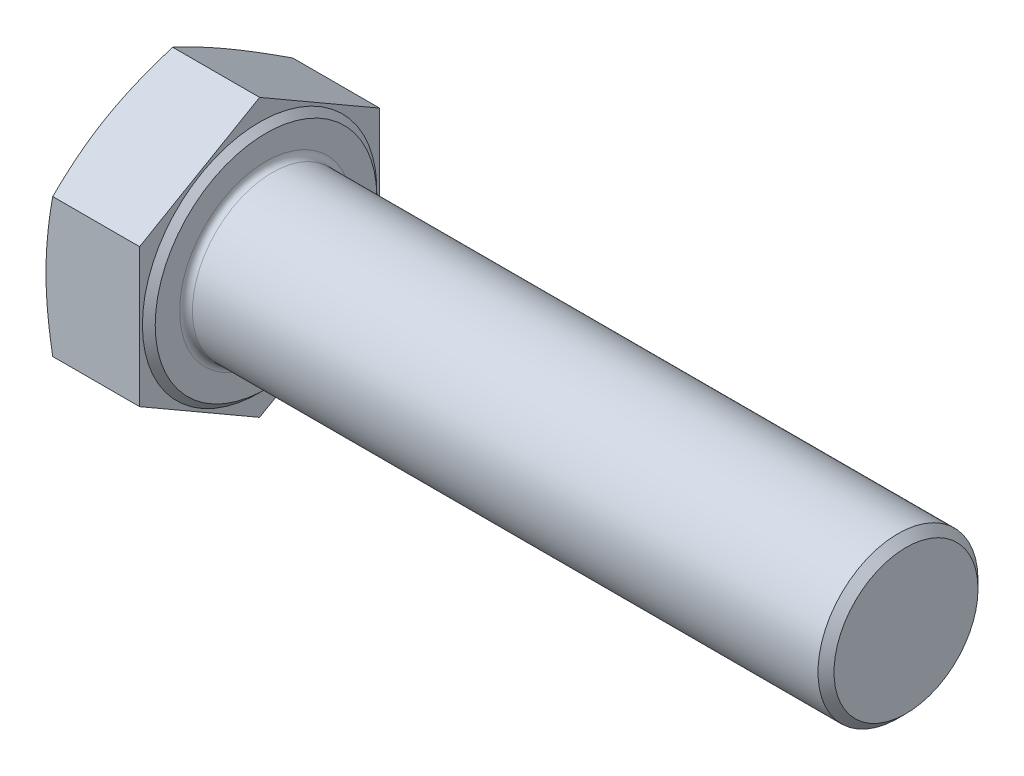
ISO-10303-21;
HEADER;
FILE_DESCRIPTION(('STEP AP214'),'2;1');
FILE_NAME('part.step','',(''),(''),'','','');
FILE_SCHEMA(('AUTOMOTIVE_DESIGN { 1 0 10303 214 1 1 1 1 }'));
ENDSEC;
DATA;
#1=APPLICATION_CONTEXT('core data for automotive mechanical design processes');
#2=APPLICATION_PROTOCOL_DEFINITION('international standard','automotive_design',2000,#1);
#3=PRODUCT_CONTEXT('',#1,'mechanical');
#4=PRODUCT('Part','Part','',(#3));
#5=PRODUCT_RELATED_PRODUCT_CATEGORY('part','',(#4));
#6=PRODUCT_DEFINITION_FORMATION('','',#4);
#7=PRODUCT_DEFINITION_CONTEXT('part definition',#1,'design');
#8=PRODUCT_DEFINITION('design','',#6,#7);
#9=PRODUCT_DEFINITION_SHAPE('','',#8);
#10=(LENGTH_UNIT() NAMED_UNIT(*) SI_UNIT(.MILLI.,.METRE.));
#11=(NAMED_UNIT(*) PLANE_ANGLE_UNIT() SI_UNIT($,.RADIAN.));
#12=(NAMED_UNIT(*) SI_UNIT($,.STERADIAN.) SOLID_ANGLE_UNIT());
#13=UNCERTAINTY_MEASURE_WITH_UNIT(LENGTH_MEASURE(1.E-05),#10,'distance_accuracy_value','');
#14=(GEOMETRIC_REPRESENTATION_CONTEXT(3) GLOBAL_UNCERTAINTY_ASSIGNED_CONTEXT((#13)) GLOBAL_UNIT_ASSIGNED_CONTEXT((#10,
#11,#12)) REPRESENTATION_CONTEXT('',''));
#15=CARTESIAN_POINT('',(0.,0.,0.));
#16=DIRECTION('',(0.,0.,1.));
#17=DIRECTION('',(1.,0.,0.));
#18=AXIS2_PLACEMENT_3D('',#15,#16,#17);
#19=CARTESIAN_POINT('',(12.5,-25.9807621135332,-15.));
#20=DIRECTION('',(1.,0.,0.));
#21=DIRECTION('',(0.,0.,-1.));
#22=AXIS2_PLACEMENT_3D('',#19,#20,#21);
#23=PLANE('',#22);
#24=CARTESIAN_POINT('',(12.5,0.,0.));
#25=DIRECTION('',(1.,0.,0.));
#26=DIRECTION('',(0.,0.,-1.));
#27=AXIS2_PLACEMENT_3D('',#24,#25,#26);
#28=CIRCLE('',#27,10.8);
#29=CARTESIAN_POINT('',(12.5,0.,-10.8));
#30=VERTEX_POINT('',#29);
#31=EDGE_CURVE('E11',#30,#30,#28,.F.);
#32=ORIENTED_EDGE('',*,*,#31,.T.);
#33=EDGE_LOOP('',(#32));
#34=FACE_BOUND('',#33,.T.);
#35=CARTESIAN_POINT('',(12.5,0.,0.));
#36=DIRECTION('',(-1.,0.,0.));
#37=DIRECTION('',(0.,0.,1.));
#38=AXIS2_PLACEMENT_3D('',#35,#36,#37);
#39=CIRCLE('',#38,13.85);
#40=CARTESIAN_POINT('',(12.5,0.,13.85));
#41=VERTEX_POINT('',#40);
#42=EDGE_CURVE('E257',#41,#41,#39,.T.);
#43=ORIENTED_EDGE('',*,*,#42,.F.);
#44=EDGE_LOOP('',(#43));
#45=FACE_BOUND('',#44,.T.);
#46=ADVANCED_FACE('F32',(#34,#45),#23,.T.);
#47=CARTESIAN_POINT('',(12.5,-8.66025403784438,15.));
#48=DIRECTION('',(0.,0.866025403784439,-0.5));
#49=DIRECTION('',(0.,0.5,0.866025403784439));
#50=AXIS2_PLACEMENT_3D('',#47,#48,#49);
#51=PLANE('',#50);
#52=CARTESIAN_POINT('',(0.844637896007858,-17.3206235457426,-0.000199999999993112));
#53=CARTESIAN_POINT('',(0.779364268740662,-17.1412736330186,0.310443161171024));
#54=CARTESIAN_POINT('',(0.717026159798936,-16.961660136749,0.621542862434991));
#55=CARTESIAN_POINT('',(0.598866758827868,-16.6018815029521,1.24469773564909));
#56=CARTESIAN_POINT('',(0.543046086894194,-16.4217163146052,1.55675299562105));
#57=CARTESIAN_POINT('',(0.386274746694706,-15.8801582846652,2.49475901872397));
#58=CARTESIAN_POINT('',(0.29610680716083,-15.5179509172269,3.12212058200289));
#59=CARTESIAN_POINT('',(0.186523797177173,-14.9750944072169,4.06237563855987));
#60=CARTESIAN_POINT('',(0.154367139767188,-14.7950715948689,4.3741842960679));
#61=CARTESIAN_POINT('',(0.0988350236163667,-14.4346898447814,4.99838379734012));
#62=CARTESIAN_POINT('',(0.0754592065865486,-14.2543309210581,5.31077461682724));
#63=CARTESIAN_POINT('',(0.0378970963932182,-13.8934354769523,5.93586386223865));
#64=CARTESIAN_POINT('',(0.0237076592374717,-13.7128990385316,6.24856214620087));
#65=CARTESIAN_POINT('',(0.00475912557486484,-13.3517020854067,6.87417362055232));
#66=CARTESIAN_POINT('',(0.,-13.1710415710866,7.18708681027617));
#67=CARTESIAN_POINT('',(0.,-12.8097205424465,7.81291318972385));
#68=CARTESIAN_POINT('',(0.00475912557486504,-12.6290600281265,8.12582637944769));
#69=CARTESIAN_POINT('',(0.0237076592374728,-12.2678630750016,8.75143785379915));
#70=CARTESIAN_POINT('',(0.0378970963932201,-12.0873266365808,9.06413613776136));
#71=CARTESIAN_POINT('',(0.0754592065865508,-11.726431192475,9.68922538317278));
#72=CARTESIAN_POINT('',(0.0988350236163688,-11.5460722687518,10.0016162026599));
#73=CARTESIAN_POINT('',(0.15436713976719,-11.1856905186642,10.6258157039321));
#74=CARTESIAN_POINT('',(0.186523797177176,-11.0056677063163,10.9376243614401));
#75=CARTESIAN_POINT('',(0.296106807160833,-10.4628111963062,11.8778794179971));
#76=CARTESIAN_POINT('',(0.386274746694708,-10.1006038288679,12.505240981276));
#77=CARTESIAN_POINT('',(0.543046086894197,-9.55904579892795,13.443247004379));
#78=CARTESIAN_POINT('',(0.598866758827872,-9.3788806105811,13.7553022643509));
#79=CARTESIAN_POINT('',(0.717026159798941,-9.01910197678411,14.378457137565));
#80=CARTESIAN_POINT('',(0.779364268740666,-8.83948848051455,14.689556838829));
#81=CARTESIAN_POINT('',(0.844637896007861,-8.66013856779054,15.0002));
#82=B_SPLINE_CURVE_WITH_KNOTS('',3,(#52,#53,#54,#55,#56,#57,#58,#59,#60,#61,#62,#63,#64,#65,#66,
#67,#68,#69,#70,#71,#72,#73,#74,#75,#76,#77,#78,#79,#80,#81),.UNSPECIFIED.,.F.,.F.,(4,2,2,2,2,2,
2,2,2,2,2,2,2,2,4),(0.,1.0937389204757,2.18758181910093,4.37677976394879,5.46113055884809,
6.54543710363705,7.62937235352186,8.71330426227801,9.79723617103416,10.881171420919,
11.9654779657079,13.0498287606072,15.2390267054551,16.3328696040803,17.426608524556),.UNSPECIFIED.);
#83=CARTESIAN_POINT('',(0.844595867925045,-17.3205080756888,0.));
#84=VERTEX_POINT('',#83);
#85=CARTESIAN_POINT('',(0.,-12.9903810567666,7.5));
#86=VERTEX_POINT('',#85);
#87=EDGE_CURVE('E276',#84,#86,#82,.T.);
#88=ORIENTED_EDGE('',*,*,#87,.F.);
#89=DIRECTION('',(-1.,0.,0.));
#90=VECTOR('',#89,1.);
#91=CARTESIAN_POINT('',(12.5,-17.3205080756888,0.));
#92=LINE('',#91,#90);
#93=CARTESIAN_POINT('',(11.7,-17.3205080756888,0.));
#94=VERTEX_POINT('',#93);
#95=EDGE_CURVE('E142',#94,#84,#92,.T.);
#96=ORIENTED_EDGE('',*,*,#95,.F.);
#97=DIRECTION('',(0.,-0.5,-0.866025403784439));
#98=VECTOR('',#97,1.);
#99=CARTESIAN_POINT('',(11.7,-8.66025403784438,15.));
#100=LINE('',#99,#98);
#101=CARTESIAN_POINT('',(11.7,-8.66025403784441,15.));
#102=VERTEX_POINT('',#101);
#103=EDGE_CURVE('E133',#102,#94,#100,.T.);
#104=ORIENTED_EDGE('',*,*,#103,.F.);
#105=DIRECTION('',(-1.,0.,0.));
#106=VECTOR('',#105,1.);
#107=CARTESIAN_POINT('',(12.5,-8.66025403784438,15.));
#108=LINE('',#107,#106);
#109=CARTESIAN_POINT('',(0.844595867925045,-8.66025403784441,15.));
#110=VERTEX_POINT('',#109);
#111=EDGE_CURVE('E128',#102,#110,#108,.T.);
#112=ORIENTED_EDGE('',*,*,#111,.T.);
#113=EDGE_CURVE('E121',#86,#110,#82,.T.);
#114=ORIENTED_EDGE('',*,*,#113,.F.);
#115=EDGE_LOOP('',(#88,#96,#104,#112,#114));
#116=FACE_BOUND('',#115,.T.);
#117=ADVANCED_FACE('F34',(#116),#51,.F.);
#118=CARTESIAN_POINT('',(12.5,-17.3205080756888,0.));
#119=DIRECTION('',(0.,0.866025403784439,0.5));
#120=DIRECTION('',(0.,-0.5,0.866025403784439));
#121=AXIS2_PLACEMENT_3D('',#118,#119,#120);
#122=PLANE('',#121);
#123=CARTESIAN_POINT('',(0.844637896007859,-8.66013856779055,-15.0002));
#124=CARTESIAN_POINT('',(0.779364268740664,-8.83948848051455,-14.689556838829));
#125=CARTESIAN_POINT('',(0.717026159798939,-9.01910197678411,-14.378457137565));
#126=CARTESIAN_POINT('',(0.59886675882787,-9.3788806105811,-13.7553022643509));
#127=CARTESIAN_POINT('',(0.543046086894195,-9.55904579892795,-13.443247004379));
#128=CARTESIAN_POINT('',(0.386274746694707,-10.1006038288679,-12.505240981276));
#129=CARTESIAN_POINT('',(0.296106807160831,-10.4628111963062,-11.8778794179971));
#130=CARTESIAN_POINT('',(0.186523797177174,-11.0056677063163,-10.9376243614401));
#131=CARTESIAN_POINT('',(0.154367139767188,-11.1856905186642,-10.6258157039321));
#132=CARTESIAN_POINT('',(0.0988350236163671,-11.5460722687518,-10.0016162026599));
#133=CARTESIAN_POINT('',(0.075459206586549,-11.726431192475,-9.68922538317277));
#134=CARTESIAN_POINT('',(0.0378970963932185,-12.0873266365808,-9.06413613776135));
#135=CARTESIAN_POINT('',(0.0237076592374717,-12.2678630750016,-8.75143785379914));
#136=CARTESIAN_POINT('',(0.0047591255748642,-12.6290600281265,-8.12582637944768));
#137=CARTESIAN_POINT('',(0.,-12.8097205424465,-7.81291318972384));
#138=CARTESIAN_POINT('',(0.,-13.1710415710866,-7.18708681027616));
#139=CARTESIAN_POINT('',(0.00475912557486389,-13.3517020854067,-6.87417362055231));
#140=CARTESIAN_POINT('',(0.0237076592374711,-13.7128990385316,-6.24856214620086));
#141=CARTESIAN_POINT('',(0.0378970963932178,-13.8934354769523,-5.93586386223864));
#142=CARTESIAN_POINT('',(0.0754592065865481,-14.2543309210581,-5.31077461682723));
#143=CARTESIAN_POINT('',(0.0988350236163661,-14.4346898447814,-4.99838379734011));
#144=CARTESIAN_POINT('',(0.154367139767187,-14.7950715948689,-4.37418429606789));
#145=CARTESIAN_POINT('',(0.186523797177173,-14.9750944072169,-4.06237563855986));
#146=CARTESIAN_POINT('',(0.296106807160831,-15.5179509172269,-3.12212058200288));
#147=CARTESIAN_POINT('',(0.386274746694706,-15.8801582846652,-2.49475901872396));
#148=CARTESIAN_POINT('',(0.543046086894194,-16.4217163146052,-1.55675299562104));
#149=CARTESIAN_POINT('',(0.598866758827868,-16.6018815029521,-1.24469773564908));
#150=CARTESIAN_POINT('',(0.717026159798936,-16.961660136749,-0.621542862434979));
#151=CARTESIAN_POINT('',(0.779364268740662,-17.1412736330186,-0.310443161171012));
#152=CARTESIAN_POINT('',(0.844637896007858,-17.3206235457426,0.000200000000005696));
#153=B_SPLINE_CURVE_WITH_KNOTS('',3,(#123,#124,#125,#126,#127,#128,#129,#130,#131,#132,#133,
#134,#135,#136,#137,#138,#139,#140,#141,#142,#143,#144,#145,#146,#147,#148,#149,#150,#151,#152),
.UNSPECIFIED.,.F.,.F.,(4,2,2,2,2,2,2,2,2,2,2,2,2,2,4),(0.,1.0937389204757,2.18758181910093,
4.37677976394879,5.46113055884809,6.54543710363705,7.62937235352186,8.71330426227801,
9.79723617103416,10.881171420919,11.9654779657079,13.0498287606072,15.2390267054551,
16.3328696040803,17.426608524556),.UNSPECIFIED.);
#154=CARTESIAN_POINT('',(0.844595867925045,-8.66025403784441,-15.));
#155=VERTEX_POINT('',#154);
#156=CARTESIAN_POINT('',(0.,-12.9903810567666,-7.49999999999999));
#157=VERTEX_POINT('',#156);
#158=EDGE_CURVE('E229',#155,#157,#153,.T.);
#159=ORIENTED_EDGE('',*,*,#158,.F.);
#160=DIRECTION('',(-1.,0.,0.));
#161=VECTOR('',#160,1.);
#162=CARTESIAN_POINT('',(12.5,-8.66025403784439,-15.));
#163=LINE('',#162,#161);
#164=CARTESIAN_POINT('',(11.7,-8.66025403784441,-15.));
#165=VERTEX_POINT('',#164);
#166=EDGE_CURVE('E139',#165,#155,#163,.T.);
#167=ORIENTED_EDGE('',*,*,#166,.F.);
#168=DIRECTION('',(0.,0.5,-0.866025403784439));
#169=VECTOR('',#168,1.);
#170=CARTESIAN_POINT('',(11.7,-17.3205080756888,0.));
#171=LINE('',#170,#169);
#172=EDGE_CURVE('E266',#94,#165,#171,.T.);
#173=ORIENTED_EDGE('',*,*,#172,.F.);
#174=ORIENTED_EDGE('',*,*,#95,.T.);
#175=EDGE_CURVE('E225',#157,#84,#153,.T.);
#176=ORIENTED_EDGE('',*,*,#175,.F.);
#177=EDGE_LOOP('',(#159,#167,#173,#174,#176));
#178=FACE_BOUND('',#177,.T.);
#179=ADVANCED_FACE('F180',(#178),#122,.F.);
#180=CARTESIAN_POINT('',(12.5,-8.66025403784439,-15.));
#181=DIRECTION('',(0.,0.,1.));
#182=DIRECTION('',(1.,0.,0.));
#183=AXIS2_PLACEMENT_3D('',#180,#181,#182);
#184=PLANE('',#183);
#185=CARTESIAN_POINT('',(4.5131853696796,-22.9293075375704,-15.));
#186=CARTESIAN_POINT('',(4.40983513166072,-22.5899853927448,-15.));
#187=CARTESIAN_POINT('',(4.30710990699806,-22.2504729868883,-15.));
#188=CARTESIAN_POINT('',(4.10304940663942,-21.5710286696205,-15.));
#189=CARTESIAN_POINT('',(4.0017141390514,-21.2310967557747,-15.));
#190=CARTESIAN_POINT('',(3.69999008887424,-20.2105689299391,-15.));
#191=CARTESIAN_POINT('',(3.50189837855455,-19.5292910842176,-15.));
#192=CARTESIAN_POINT('',(3.11288892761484,-18.163310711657,-15.));
#193=CARTESIAN_POINT('',(2.92198526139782,-17.4786041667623,-15.));
#194=CARTESIAN_POINT('',(2.54957050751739,-16.1066443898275,-15.));
#195=CARTESIAN_POINT('',(2.36805925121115,-15.4193912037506,-15.));
#196=CARTESIAN_POINT('',(2.0189263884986,-14.0503721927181,-15.));
#197=CARTESIAN_POINT('',(1.851161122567,-13.368643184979,-15.));
#198=CARTESIAN_POINT('',(1.5299135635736,-12.0017928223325,-15.));
#199=CARTESIAN_POINT('',(1.37643151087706,-11.3166714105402,-15.));
#200=CARTESIAN_POINT('',(1.08732897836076,-9.94288290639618,-15.));
#201=CARTESIAN_POINT('',(0.951702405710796,-9.25421710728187,-15.));
#202=CARTESIAN_POINT('',(0.702440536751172,-7.8728873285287,-15.));
#203=CARTESIAN_POINT('',(0.588804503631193,-7.18022348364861,-15.));
#204=CARTESIAN_POINT('',(0.399391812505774,-5.86889428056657,-15.));
#205=CARTESIAN_POINT('',(0.320798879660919,-5.25063953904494,-15.));
#206=CARTESIAN_POINT('',(0.187759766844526,-4.01151576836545,-15.));
#207=CARTESIAN_POINT('',(0.133312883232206,-3.39064681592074,-15.));
#208=CARTESIAN_POINT('',(0.0511879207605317,-2.14755397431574,-15.));
#209=CARTESIAN_POINT('',(0.0234909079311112,-1.52533135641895,-15.));
#210=CARTESIAN_POINT('',(-0.00373201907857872,-0.280263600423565,-15.));
#211=CARTESIAN_POINT('',(-0.0032581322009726,0.342581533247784,-15.));
#212=CARTESIAN_POINT('',(0.0259087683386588,1.5907602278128,-15.));
#213=CARTESIAN_POINT('',(0.0547448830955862,2.21609038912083,-15.));
#214=CARTESIAN_POINT('',(0.139309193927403,3.46491396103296,-15.));
#215=CARTESIAN_POINT('',(0.195038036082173,4.08840732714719,-15.));
#216=CARTESIAN_POINT('',(0.330780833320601,5.33324943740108,-15.));
#217=CARTESIAN_POINT('',(0.410815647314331,5.95459587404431,-15.));
#218=CARTESIAN_POINT('',(0.591923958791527,7.19418030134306,-15.));
#219=CARTESIAN_POINT('',(0.692997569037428,7.81241827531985,-15.));
#220=CARTESIAN_POINT('',(0.918710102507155,9.07831857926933,-15.));
#221=CARTESIAN_POINT('',(1.04431272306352,9.72580754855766,-15.));
#222=CARTESIAN_POINT('',(1.3116837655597,11.0174604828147,-15.));
#223=CARTESIAN_POINT('',(1.45345340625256,11.6616241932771,-15.));
#224=CARTESIAN_POINT('',(1.75018161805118,12.9470856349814,-15.));
#225=CARTESIAN_POINT('',(1.90514401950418,13.5883824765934,-15.));
#226=CARTESIAN_POINT('',(2.22573697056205,14.8682746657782,-15.));
#227=CARTESIAN_POINT('',(2.39136726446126,15.5068700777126,-15.));
#228=CARTESIAN_POINT('',(2.73152020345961,16.7825582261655,-15.));
#229=CARTESIAN_POINT('',(2.90605399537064,17.419647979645,-15.));
#230=CARTESIAN_POINT('',(3.26222144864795,18.6918370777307,-15.));
#231=CARTESIAN_POINT('',(3.4438551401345,19.3269364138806,-15.));
#232=CARTESIAN_POINT('',(3.81292279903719,20.5953282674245,-15.));
#233=CARTESIAN_POINT('',(4.00035578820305,21.2286210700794,-15.));
#234=CARTESIAN_POINT('',(4.38004374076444,22.4937555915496,-15.));
#235=CARTESIAN_POINT('',(4.57229869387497,23.1255973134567,-15.));
#236=CARTESIAN_POINT('',(4.95868121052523,24.3810727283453,-15.));
#237=CARTESIAN_POINT('',(5.15276465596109,25.0047200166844,-15.));
#238=CARTESIAN_POINT('',(5.54424157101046,26.2509755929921,-15.));
#239=CARTESIAN_POINT('',(5.74163505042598,26.8735838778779,-15.));
#240=CARTESIAN_POINT('',(6.33801421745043,28.7401261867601,-15.));
#241=CARTESIAN_POINT('',(6.74118201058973,29.9827239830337,-15.));
#242=CARTESIAN_POINT('',(7.55410304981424,32.4605337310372,-15.));
#243=CARTESIAN_POINT('',(7.96382550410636,33.6957558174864,-15.));
#244=CARTESIAN_POINT('',(8.58295834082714,35.5470094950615,-15.));
#245=CARTESIAN_POINT('',(8.79008571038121,36.1638059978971,-15.));
#246=CARTESIAN_POINT('',(9.20568070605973,37.3969457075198,-15.));
#247=CARTESIAN_POINT('',(9.41414832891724,38.0132889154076,-15.));
#248=CARTESIAN_POINT('',(9.62319587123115,38.6294352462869,-15.));
#249=B_SPLINE_CURVE_WITH_KNOTS('',3,(#185,#186,#187,#188,#189,#190,#191,#192,#193,#194,#195,
#196,#197,#198,#199,#200,#201,#202,#203,#204,#205,#206,#207,#208,#209,#210,#211,#212,#213,#214,
#215,#216,#217,#218,#219,#220,#221,#222,#223,#224,#225,#226,#227,#228,#229,#230,#231,#232,#233,
#234,#235,#236,#237,#238,#239,#240,#241,#242,#243,#244,#245,#246,#247,#248),.UNSPECIFIED.,.F.,
.F.,(4,2,2,2,2,2,2,2,2,2,2,2,2,2,2,2,2,2,2,2,2,2,2,2,2,2,2,2,2,2,2,4),(0.,1.06413565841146,
2.12827752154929,4.25671855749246,6.38913073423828,8.5215046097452,10.6275874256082,
12.7337056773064,14.8391033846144,16.9444305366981,18.81371040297,20.6829357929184,
22.5508371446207,24.4187253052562,26.2960864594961,28.1734927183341,30.052514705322,
31.9315467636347,33.9099705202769,35.888543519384,37.8676929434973,39.8467949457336,
41.8284386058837,43.8100906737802,45.7914102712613,47.7727256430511,49.732163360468,
51.6916068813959,55.6106625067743,59.5148479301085,61.4667833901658,63.4187140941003),.UNSPECIFIED.);
#250=CARTESIAN_POINT('',(0.844595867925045,8.66025403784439,-15.));
#251=VERTEX_POINT('',#250);
#252=CARTESIAN_POINT('',(0.,0.,-15.));
#253=VERTEX_POINT('',#252);
#254=EDGE_CURVE('E292',#251,#253,#249,.F.);
#255=ORIENTED_EDGE('',*,*,#254,.F.);
#256=DIRECTION('',(-1.,0.,0.));
#257=VECTOR('',#256,1.);
#258=CARTESIAN_POINT('',(12.5,8.6602540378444,-15.));
#259=LINE('',#258,#257);
#260=CARTESIAN_POINT('',(11.7,8.66025403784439,-15.));
#261=VERTEX_POINT('',#260);
#262=EDGE_CURVE('E130',#261,#251,#259,.T.);
#263=ORIENTED_EDGE('',*,*,#262,.F.);
#264=DIRECTION('',(0.,1.,0.));
#265=VECTOR('',#264,1.);
#266=CARTESIAN_POINT('',(11.7,-8.66025403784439,-15.));
#267=LINE('',#266,#265);
#268=EDGE_CURVE('E259',#165,#261,#267,.T.);
#269=ORIENTED_EDGE('',*,*,#268,.F.);
#270=ORIENTED_EDGE('',*,*,#166,.T.);
#271=EDGE_CURVE('E230',#253,#155,#249,.F.);
#272=ORIENTED_EDGE('',*,*,#271,.F.);
#273=EDGE_LOOP('',(#255,#263,#269,#270,#272));
#274=FACE_BOUND('',#273,.T.);
#275=ADVANCED_FACE('F238',(#274),#184,.F.);
#276=CARTESIAN_POINT('',(12.5,8.6602540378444,-15.));
#277=DIRECTION('',(0.,-0.866025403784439,0.5));
#278=DIRECTION('',(0.,-0.5,-0.866025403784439));
#279=AXIS2_PLACEMENT_3D('',#276,#277,#278);
#280=PLANE('',#279);
#281=CARTESIAN_POINT('',(0.844637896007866,17.3206235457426,0.000199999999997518));
#282=CARTESIAN_POINT('',(0.77936426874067,17.1412736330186,-0.31044316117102));
#283=CARTESIAN_POINT('',(0.717026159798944,16.9616601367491,-0.621542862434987));
#284=CARTESIAN_POINT('',(0.598866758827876,16.6018815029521,-1.24469773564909));
#285=CARTESIAN_POINT('',(0.543046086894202,16.4217163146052,-1.55675299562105));
#286=CARTESIAN_POINT('',(0.386274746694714,15.8801582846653,-2.49475901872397));
#287=CARTESIAN_POINT('',(0.296106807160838,15.5179509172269,-3.12212058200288));
#288=CARTESIAN_POINT('',(0.18652379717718,14.9750944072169,-4.06237563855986));
#289=CARTESIAN_POINT('',(0.154367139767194,14.795071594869,-4.37418429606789));
#290=CARTESIAN_POINT('',(0.0988350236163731,14.4346898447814,-4.99838379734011));
#291=CARTESIAN_POINT('',(0.0754592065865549,14.2543309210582,-5.31077461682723));
#292=CARTESIAN_POINT('',(0.0378970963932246,13.8934354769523,-5.93586386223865));
#293=CARTESIAN_POINT('',(0.0237076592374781,13.7128990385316,-6.24856214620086));
#294=CARTESIAN_POINT('',(0.00475912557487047,13.3517020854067,-6.87417362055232));
#295=CARTESIAN_POINT('',(0.,13.1710415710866,-7.18708681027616));
#296=CARTESIAN_POINT('',(0.,12.8097205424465,-7.81291318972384));
#297=CARTESIAN_POINT('',(0.00475912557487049,12.6290600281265,-8.12582637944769));
#298=CARTESIAN_POINT('',(0.023707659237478,12.2678630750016,-8.75143785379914));
#299=CARTESIAN_POINT('',(0.0378970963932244,12.0873266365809,-9.06413613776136));
#300=CARTESIAN_POINT('',(0.0754592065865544,11.726431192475,-9.68922538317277));
#301=CARTESIAN_POINT('',(0.0988350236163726,11.5460722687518,-10.0016162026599));
#302=CARTESIAN_POINT('',(0.154367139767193,11.1856905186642,-10.6258157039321));
#303=CARTESIAN_POINT('',(0.186523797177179,11.0056677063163,-10.9376243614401));
#304=CARTESIAN_POINT('',(0.296106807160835,10.4628111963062,-11.8778794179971));
#305=CARTESIAN_POINT('',(0.386274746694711,10.1006038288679,-12.505240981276));
#306=CARTESIAN_POINT('',(0.543046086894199,9.55904579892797,-13.443247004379));
#307=CARTESIAN_POINT('',(0.598866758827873,9.37888061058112,-13.7553022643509));
#308=CARTESIAN_POINT('',(0.717026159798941,9.01910197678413,-14.378457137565));
#309=CARTESIAN_POINT('',(0.779364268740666,8.83948848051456,-14.689556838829));
#310=CARTESIAN_POINT('',(0.844637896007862,8.66013856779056,-15.0002));
#311=B_SPLINE_CURVE_WITH_KNOTS('',3,(#281,#282,#283,#284,#285,#286,#287,#288,#289,#290,#291,
#292,#293,#294,#295,#296,#297,#298,#299,#300,#301,#302,#303,#304,#305,#306,#307,#308,#309,#310),
.UNSPECIFIED.,.F.,.F.,(4,2,2,2,2,2,2,2,2,2,2,2,2,2,4),(0.,1.0937389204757,2.18758181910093,
4.37677976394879,5.46113055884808,6.54543710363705,7.62937235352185,8.71330426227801,
9.79723617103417,10.881171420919,11.9654779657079,13.0498287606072,15.2390267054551,
16.3328696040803,17.426608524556),.UNSPECIFIED.);
#312=CARTESIAN_POINT('',(0.844595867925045,17.3205080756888,0.));
#313=VERTEX_POINT('',#312);
#314=CARTESIAN_POINT('',(0.,12.9903810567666,-7.5));
#315=VERTEX_POINT('',#314);
#316=EDGE_CURVE('E48',#313,#315,#311,.T.);
#317=ORIENTED_EDGE('',*,*,#316,.F.);
#318=DIRECTION('',(-1.,0.,0.));
#319=VECTOR('',#318,1.);
#320=CARTESIAN_POINT('',(12.5,17.3205080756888,0.));
#321=LINE('',#320,#319);
#322=CARTESIAN_POINT('',(11.7,17.3205080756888,0.));
#323=VERTEX_POINT('',#322);
#324=EDGE_CURVE('E127',#323,#313,#321,.T.);
#325=ORIENTED_EDGE('',*,*,#324,.F.);
#326=DIRECTION('',(0.,0.5,0.866025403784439));
#327=VECTOR('',#326,1.);
#328=CARTESIAN_POINT('',(11.7,8.6602540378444,-15.));
#329=LINE('',#328,#327);
#330=EDGE_CURVE('E256',#261,#323,#329,.T.);
#331=ORIENTED_EDGE('',*,*,#330,.F.);
#332=ORIENTED_EDGE('',*,*,#262,.T.);
#333=EDGE_CURVE('E253',#315,#251,#311,.T.);
#334=ORIENTED_EDGE('',*,*,#333,.F.);
#335=EDGE_LOOP('',(#317,#325,#331,#332,#334));
#336=FACE_BOUND('',#335,.T.);
#337=ADVANCED_FACE('F242',(#336),#280,.F.);
#338=CARTESIAN_POINT('',(12.5,17.3205080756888,0.));
#339=DIRECTION('',(0.,-0.866025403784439,-0.5));
#340=DIRECTION('',(0.,0.5,-0.866025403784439));
#341=AXIS2_PLACEMENT_3D('',#338,#339,#340);
#342=PLANE('',#341);
#343=CARTESIAN_POINT('',(0.844637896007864,8.66013856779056,15.0002));
#344=CARTESIAN_POINT('',(0.779364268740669,8.83948848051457,14.689556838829));
#345=CARTESIAN_POINT('',(0.717026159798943,9.01910197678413,14.378457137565));
#346=CARTESIAN_POINT('',(0.598866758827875,9.37888061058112,13.7553022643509));
#347=CARTESIAN_POINT('',(0.5430460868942,9.55904579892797,13.443247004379));
#348=CARTESIAN_POINT('',(0.386274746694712,10.1006038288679,12.505240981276));
#349=CARTESIAN_POINT('',(0.296106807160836,10.4628111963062,11.8778794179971));
#350=CARTESIAN_POINT('',(0.18652379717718,11.0056677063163,10.9376243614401));
#351=CARTESIAN_POINT('',(0.154367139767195,11.1856905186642,10.6258157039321));
#352=CARTESIAN_POINT('',(0.0988350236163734,11.5460722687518,10.0016162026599));
#353=CARTESIAN_POINT('',(0.0754592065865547,11.726431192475,9.68922538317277));
#354=CARTESIAN_POINT('',(0.0378970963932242,12.0873266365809,9.06413613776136));
#355=CARTESIAN_POINT('',(0.0237076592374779,12.2678630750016,8.75143785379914));
#356=CARTESIAN_POINT('',(0.00475912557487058,12.6290600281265,8.12582637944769));
#357=CARTESIAN_POINT('',(0.,12.8097205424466,7.81291318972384));
#358=CARTESIAN_POINT('',(0.,13.1710415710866,7.18708681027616));
#359=CARTESIAN_POINT('',(0.00475912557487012,13.3517020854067,6.87417362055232));
#360=CARTESIAN_POINT('',(0.0237076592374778,13.7128990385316,6.24856214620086));
#361=CARTESIAN_POINT('',(0.0378970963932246,13.8934354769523,5.93586386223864));
#362=CARTESIAN_POINT('',(0.0754592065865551,14.2543309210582,5.31077461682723));
#363=CARTESIAN_POINT('',(0.0988350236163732,14.4346898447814,4.99838379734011));
#364=CARTESIAN_POINT('',(0.154367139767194,14.795071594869,4.37418429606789));
#365=CARTESIAN_POINT('',(0.18652379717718,14.9750944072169,4.06237563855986));
#366=CARTESIAN_POINT('',(0.296106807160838,15.5179509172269,3.12212058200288));
#367=CARTESIAN_POINT('',(0.386274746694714,15.8801582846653,2.49475901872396));
#368=CARTESIAN_POINT('',(0.543046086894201,16.4217163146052,1.55675299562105));
#369=CARTESIAN_POINT('',(0.598866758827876,16.6018815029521,1.24469773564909));
#370=CARTESIAN_POINT('',(0.717026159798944,16.9616601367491,0.621542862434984));
#371=CARTESIAN_POINT('',(0.77936426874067,17.1412736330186,0.310443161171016));
#372=CARTESIAN_POINT('',(0.844637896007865,17.3206235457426,-0.00020000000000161));
#373=B_SPLINE_CURVE_WITH_KNOTS('',3,(#343,#344,#345,#346,#347,#348,#349,#350,#351,#352,#353,
#354,#355,#356,#357,#358,#359,#360,#361,#362,#363,#364,#365,#366,#367,#368,#369,#370,#371,#372),
.UNSPECIFIED.,.F.,.F.,(4,2,2,2,2,2,2,2,2,2,2,2,2,2,4),(0.,1.0937389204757,2.18758181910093,
4.37677976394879,5.46113055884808,6.54543710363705,7.62937235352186,8.71330426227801,
9.79723617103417,10.881171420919,11.9654779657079,13.0498287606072,15.2390267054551,
16.3328696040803,17.426608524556),.UNSPECIFIED.);
#374=CARTESIAN_POINT('',(0.844595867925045,8.66025403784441,15.));
#375=VERTEX_POINT('',#374);
#376=CARTESIAN_POINT('',(0.,12.9903810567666,7.5));
#377=VERTEX_POINT('',#376);
#378=EDGE_CURVE('E56',#375,#377,#373,.T.);
#379=ORIENTED_EDGE('',*,*,#378,.F.);
#380=DIRECTION('',(-1.,0.,0.));
#381=VECTOR('',#380,1.);
#382=CARTESIAN_POINT('',(12.5,8.6602540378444,15.));
#383=LINE('',#382,#381);
#384=CARTESIAN_POINT('',(11.7,8.6602540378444,15.));
#385=VERTEX_POINT('',#384);
#386=EDGE_CURVE('E118',#385,#375,#383,.T.);
#387=ORIENTED_EDGE('',*,*,#386,.F.);
#388=DIRECTION('',(0.,-0.5,0.866025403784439));
#389=VECTOR('',#388,1.);
#390=CARTESIAN_POINT('',(11.7,17.3205080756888,0.));
#391=LINE('',#390,#389);
#392=EDGE_CURVE('E254',#323,#385,#391,.T.);
#393=ORIENTED_EDGE('',*,*,#392,.F.);
#394=ORIENTED_EDGE('',*,*,#324,.T.);
#395=EDGE_CURVE('E120',#377,#313,#373,.T.);
#396=ORIENTED_EDGE('',*,*,#395,.F.);
#397=EDGE_LOOP('',(#379,#387,#393,#394,#396));
#398=FACE_BOUND('',#397,.T.);
#399=ADVANCED_FACE('F116',(#398),#342,.F.);
#400=CARTESIAN_POINT('',(12.5,8.6602540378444,15.));
#401=DIRECTION('',(0.,0.,-1.));
#402=DIRECTION('',(-1.,0.,0.));
#403=AXIS2_PLACEMENT_3D('',#400,#401,#402);
#404=PLANE('',#403);
#405=CARTESIAN_POINT('',(4.51318536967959,-22.9293075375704,15.));
#406=CARTESIAN_POINT('',(4.40983513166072,-22.5899853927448,15.));
#407=CARTESIAN_POINT('',(4.30710990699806,-22.2504729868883,15.));
#408=CARTESIAN_POINT('',(4.10304940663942,-21.5710286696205,15.));
#409=CARTESIAN_POINT('',(4.0017141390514,-21.2310967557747,15.));
#410=CARTESIAN_POINT('',(3.69999008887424,-20.2105689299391,15.));
#411=CARTESIAN_POINT('',(3.50189837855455,-19.5292910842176,15.));
#412=CARTESIAN_POINT('',(3.11288892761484,-18.163310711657,15.));
#413=CARTESIAN_POINT('',(2.92198526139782,-17.4786041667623,15.));
#414=CARTESIAN_POINT('',(2.54957050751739,-16.1066443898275,15.));
#415=CARTESIAN_POINT('',(2.36805925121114,-15.4193912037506,15.));
#416=CARTESIAN_POINT('',(2.0189263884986,-14.0503721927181,15.));
#417=CARTESIAN_POINT('',(1.851161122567,-13.368643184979,15.));
#418=CARTESIAN_POINT('',(1.5299135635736,-12.0017928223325,15.));
#419=CARTESIAN_POINT('',(1.37643151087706,-11.3166714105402,15.));
#420=CARTESIAN_POINT('',(1.08732897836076,-9.94288290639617,15.));
#421=CARTESIAN_POINT('',(0.951702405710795,-9.25421710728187,15.));
#422=CARTESIAN_POINT('',(0.702440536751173,-7.8728873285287,15.));
#423=CARTESIAN_POINT('',(0.588804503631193,-7.1802234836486,15.));
#424=CARTESIAN_POINT('',(0.399391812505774,-5.86889428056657,15.));
#425=CARTESIAN_POINT('',(0.320798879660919,-5.25063953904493,15.));
#426=CARTESIAN_POINT('',(0.187759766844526,-4.01151576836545,15.));
#427=CARTESIAN_POINT('',(0.133312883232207,-3.39064681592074,15.));
#428=CARTESIAN_POINT('',(0.0511879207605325,-2.14755397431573,15.));
#429=CARTESIAN_POINT('',(0.0234909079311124,-1.52533135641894,15.));
#430=CARTESIAN_POINT('',(-0.0037320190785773,-0.280263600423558,15.));
#431=CARTESIAN_POINT('',(-0.00325813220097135,0.342581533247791,15.));
#432=CARTESIAN_POINT('',(0.0259087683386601,1.5907602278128,15.));
#433=CARTESIAN_POINT('',(0.0547448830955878,2.21609038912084,15.));
#434=CARTESIAN_POINT('',(0.139309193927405,3.46491396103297,15.));
#435=CARTESIAN_POINT('',(0.195038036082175,4.0884073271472,15.));
#436=CARTESIAN_POINT('',(0.330780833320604,5.33324943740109,15.));
#437=CARTESIAN_POINT('',(0.410815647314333,5.95459587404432,15.));
#438=CARTESIAN_POINT('',(0.591923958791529,7.19418030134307,15.));
#439=CARTESIAN_POINT('',(0.692997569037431,7.81241827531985,15.));
#440=CARTESIAN_POINT('',(0.918710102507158,9.07831857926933,15.));
#441=CARTESIAN_POINT('',(1.04431272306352,9.72580754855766,15.));
#442=CARTESIAN_POINT('',(1.3116837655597,11.0174604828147,15.));
#443=CARTESIAN_POINT('',(1.45345340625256,11.6616241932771,15.));
#444=CARTESIAN_POINT('',(1.75018161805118,12.9470856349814,15.));
#445=CARTESIAN_POINT('',(1.90514401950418,13.5883824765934,15.));
#446=CARTESIAN_POINT('',(2.22573697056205,14.8682746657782,15.));
#447=CARTESIAN_POINT('',(2.39136726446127,15.5068700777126,15.));
#448=CARTESIAN_POINT('',(2.73152020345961,16.7825582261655,15.));
#449=CARTESIAN_POINT('',(2.90605399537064,17.419647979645,15.));
#450=CARTESIAN_POINT('',(3.26222144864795,18.6918370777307,15.));
#451=CARTESIAN_POINT('',(3.4438551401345,19.3269364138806,15.));
#452=CARTESIAN_POINT('',(3.81292279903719,20.5953282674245,15.));
#453=CARTESIAN_POINT('',(4.00035578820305,21.2286210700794,15.));
#454=CARTESIAN_POINT('',(4.38004374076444,22.4937555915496,15.));
#455=CARTESIAN_POINT('',(4.57229869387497,23.1255973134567,15.));
#456=CARTESIAN_POINT('',(4.95868121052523,24.3810727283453,15.));
#457=CARTESIAN_POINT('',(5.15276465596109,25.0047200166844,15.));
#458=CARTESIAN_POINT('',(5.54424157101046,26.2509755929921,15.));
#459=CARTESIAN_POINT('',(5.74163505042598,26.8735838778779,15.));
#460=CARTESIAN_POINT('',(6.33801421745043,28.7401261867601,15.));
#461=CARTESIAN_POINT('',(6.74118201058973,29.9827239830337,15.));
#462=CARTESIAN_POINT('',(7.55410304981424,32.4605337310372,15.));
#463=CARTESIAN_POINT('',(7.96382550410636,33.6957558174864,15.));
#464=CARTESIAN_POINT('',(8.58295834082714,35.5470094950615,15.));
#465=CARTESIAN_POINT('',(8.79008571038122,36.1638059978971,15.));
#466=CARTESIAN_POINT('',(9.20568070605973,37.3969457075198,15.));
#467=CARTESIAN_POINT('',(9.41414832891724,38.0132889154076,15.));
#468=CARTESIAN_POINT('',(9.62319587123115,38.6294352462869,15.));
#469=B_SPLINE_CURVE_WITH_KNOTS('',3,(#405,#406,#407,#408,#409,#410,#411,#412,#413,#414,#415,
#416,#417,#418,#419,#420,#421,#422,#423,#424,#425,#426,#427,#428,#429,#430,#431,#432,#433,#434,
#435,#436,#437,#438,#439,#440,#441,#442,#443,#444,#445,#446,#447,#448,#449,#450,#451,#452,#453,
#454,#455,#456,#457,#458,#459,#460,#461,#462,#463,#464,#465,#466,#467,#468),.UNSPECIFIED.,.F.,
.F.,(4,2,2,2,2,2,2,2,2,2,2,2,2,2,2,2,2,2,2,2,2,2,2,2,2,2,2,2,2,2,2,4),(0.,1.06413565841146,
2.12827752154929,4.25671855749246,6.38913073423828,8.5215046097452,10.6275874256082,
12.7337056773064,14.8391033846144,16.9444305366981,18.81371040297,20.6829357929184,
22.5508371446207,24.4187253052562,26.2960864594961,28.1734927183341,30.052514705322,
31.9315467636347,33.9099705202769,35.888543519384,37.8676929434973,39.8467949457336,
41.8284386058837,43.8100906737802,45.7914102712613,47.7727256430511,49.732163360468,
51.6916068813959,55.6106625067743,59.5148479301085,61.4667833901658,63.4187140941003),.UNSPECIFIED.);
#470=CARTESIAN_POINT('',(0.,0.,15.));
#471=VERTEX_POINT('',#470);
#472=EDGE_CURVE('E111',#110,#471,#469,.T.);
#473=ORIENTED_EDGE('',*,*,#472,.F.);
#474=ORIENTED_EDGE('',*,*,#111,.F.);
#475=DIRECTION('',(0.,-1.,0.));
#476=VECTOR('',#475,1.);
#477=CARTESIAN_POINT('',(11.7,8.6602540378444,15.));
#478=LINE('',#477,#476);
#479=EDGE_CURVE('E126',#385,#102,#478,.T.);
#480=ORIENTED_EDGE('',*,*,#479,.F.);
#481=ORIENTED_EDGE('',*,*,#386,.T.);
#482=EDGE_CURVE('E103',#471,#375,#469,.T.);
#483=ORIENTED_EDGE('',*,*,#482,.F.);
#484=EDGE_LOOP('',(#473,#474,#480,#481,#483));
#485=FACE_BOUND('',#484,.T.);
#486=ADVANCED_FACE('F124',(#485),#404,.F.);
#487=CARTESIAN_POINT('',(11.7,14.65,0.));
#488=DIRECTION('',(1.,0.,0.));
#489=DIRECTION('',(0.,0.,-1.));
#490=AXIS2_PLACEMENT_3D('',#487,#488,#489);
#491=PLANE('',#490);
#492=CARTESIAN_POINT('',(11.7,0.,0.));
#493=DIRECTION('',(-1.,0.,0.));
#494=DIRECTION('',(0.,0.,1.));
#495=AXIS2_PLACEMENT_3D('',#492,#493,#494);
#496=CIRCLE('',#495,14.65);
#497=CARTESIAN_POINT('',(11.7,0.,14.65));
#498=VERTEX_POINT('',#497);
#499=EDGE_CURVE('E262',#498,#498,#496,.T.);
#500=ORIENTED_EDGE('',*,*,#499,.T.);
#501=EDGE_LOOP('',(#500));
#502=FACE_BOUND('',#501,.T.);
#503=ORIENTED_EDGE('',*,*,#103,.T.);
#504=ORIENTED_EDGE('',*,*,#172,.T.);
#505=ORIENTED_EDGE('',*,*,#268,.T.);
#506=ORIENTED_EDGE('',*,*,#330,.T.);
#507=ORIENTED_EDGE('',*,*,#392,.T.);
#508=ORIENTED_EDGE('',*,*,#479,.T.);
#509=EDGE_LOOP('',(#503,#504,#505,#506,#507,#508));
#510=FACE_BOUND('',#509,.T.);
#511=ADVANCED_FACE('F190',(#502,#510),#491,.T.);
#512=CARTESIAN_POINT('',(11.7,0.,0.));
#513=DIRECTION('',(-1.,0.,0.));
#514=DIRECTION('',(0.,0.,1.));
#515=AXIS2_PLACEMENT_3D('',#512,#513,#514);
#516=CONICAL_SURFACE('',#515,14.65,0.785398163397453);
#517=ORIENTED_EDGE('',*,*,#42,.T.);
#518=EDGE_LOOP('',(#517));
#519=FACE_BOUND('',#518,.T.);
#520=ORIENTED_EDGE('',*,*,#499,.F.);
#521=EDGE_LOOP('',(#520));
#522=FACE_BOUND('',#521,.T.);
#523=ADVANCED_FACE('F297',(#519,#522),#516,.T.);
#524=CARTESIAN_POINT('',(0.,0.,0.));
#525=DIRECTION('',(1.,0.,0.));
#526=DIRECTION('',(0.,0.,-1.));
#527=AXIS2_PLACEMENT_3D('',#524,#525,#526);
#528=CONICAL_SURFACE('',#527,15.,1.22173047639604);
#529=ORIENTED_EDGE('',*,*,#271,.T.);
#530=ORIENTED_EDGE('',*,*,#158,.T.);
#531=CARTESIAN_POINT('',(0.,0.,0.));
#532=DIRECTION('',(1.,0.,0.));
#533=DIRECTION('',(0.,0.,-1.));
#534=AXIS2_PLACEMENT_3D('',#531,#532,#533);
#535=CIRCLE('',#534,15.);
#536=EDGE_CURVE('E146',#157,#253,#535,.T.);
#537=ORIENTED_EDGE('',*,*,#536,.T.);
#538=EDGE_LOOP('',(#529,#530,#537));
#539=FACE_BOUND('',#538,.T.);
#540=ADVANCED_FACE('F209',(#539),#528,.T.);
#541=ORIENTED_EDGE('',*,*,#175,.T.);
#542=ORIENTED_EDGE('',*,*,#87,.T.);
#543=EDGE_CURVE('E149',#86,#157,#535,.T.);
#544=ORIENTED_EDGE('',*,*,#543,.T.);
#545=EDGE_LOOP('',(#541,#542,#544));
#546=FACE_BOUND('',#545,.T.);
#547=ADVANCED_FACE('F288',(#546),#528,.T.);
#548=ORIENTED_EDGE('',*,*,#113,.T.);
#549=ORIENTED_EDGE('',*,*,#472,.T.);
#550=EDGE_CURVE('E281',#471,#86,#535,.T.);
#551=ORIENTED_EDGE('',*,*,#550,.T.);
#552=EDGE_LOOP('',(#548,#549,#551));
#553=FACE_BOUND('',#552,.T.);
#554=ADVANCED_FACE('F280',(#553),#528,.T.);
#555=ORIENTED_EDGE('',*,*,#378,.T.);
#556=CARTESIAN_POINT('',(0.,0.,0.));
#557=DIRECTION('',(-1.,0.,0.));
#558=DIRECTION('',(0.,0.,1.));
#559=AXIS2_PLACEMENT_3D('',#556,#557,#558);
#560=CIRCLE('',#559,15.);
#561=EDGE_CURVE('E106',#471,#377,#560,.T.);
#562=ORIENTED_EDGE('',*,*,#561,.F.);
#563=ORIENTED_EDGE('',*,*,#482,.T.);
#564=EDGE_LOOP('',(#555,#562,#563));
#565=FACE_BOUND('',#564,.T.);
#566=ADVANCED_FACE('F104',(#565),#528,.T.);
#567=ORIENTED_EDGE('',*,*,#316,.T.);
#568=EDGE_CURVE('E284',#315,#377,#535,.T.);
#569=ORIENTED_EDGE('',*,*,#568,.T.);
#570=ORIENTED_EDGE('',*,*,#395,.T.);
#571=EDGE_LOOP('',(#567,#569,#570));
#572=FACE_BOUND('',#571,.T.);
#573=ADVANCED_FACE('F207',(#572),#528,.T.);
#574=ORIENTED_EDGE('',*,*,#254,.T.);
#575=EDGE_CURVE('E150',#253,#315,#535,.T.);
#576=ORIENTED_EDGE('',*,*,#575,.T.);
#577=ORIENTED_EDGE('',*,*,#333,.T.);
#578=EDGE_LOOP('',(#574,#576,#577));
#579=FACE_BOUND('',#578,.T.);
#580=ADVANCED_FACE('F202',(#579),#528,.T.);
#581=CARTESIAN_POINT('',(0.,-25.9807621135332,-15.));
#582=DIRECTION('',(1.,0.,0.));
#583=DIRECTION('',(0.,0.,-1.));
#584=AXIS2_PLACEMENT_3D('',#581,#582,#583);
#585=PLANE('',#584);
#586=ORIENTED_EDGE('',*,*,#575,.F.);
#587=ORIENTED_EDGE('',*,*,#536,.F.);
#588=ORIENTED_EDGE('',*,*,#543,.F.);
#589=ORIENTED_EDGE('',*,*,#550,.F.);
#590=ORIENTED_EDGE('',*,*,#561,.T.);
#591=ORIENTED_EDGE('',*,*,#568,.F.);
#592=EDGE_LOOP('',(#586,#587,#588,#589,#590,#591));
#593=FACE_BOUND('',#592,.T.);
#594=ADVANCED_FACE('F185',(#593),#585,.F.);
#595=CARTESIAN_POINT('',(92.5,0.,0.));
#596=DIRECTION('',(-1.,0.,0.));
#597=DIRECTION('',(0.,0.,1.));
#598=AXIS2_PLACEMENT_3D('',#595,#596,#597);
#599=CYLINDRICAL_SURFACE('',#598,10.);
#600=CARTESIAN_POINT('',(13.3,0.,0.));
#601=DIRECTION('',(1.,0.,0.));
#602=DIRECTION('',(0.,0.,-1.));
#603=AXIS2_PLACEMENT_3D('',#600,#601,#602);
#604=CIRCLE('',#603,10.);
#605=CARTESIAN_POINT('',(13.3,0.,-10.));
#606=VERTEX_POINT('',#605);
#607=EDGE_CURVE('E41',#606,#606,#604,.T.);
#608=ORIENTED_EDGE('',*,*,#607,.T.);
#609=EDGE_LOOP('',(#608));
#610=FACE_BOUND('',#609,.T.);
#611=CARTESIAN_POINT('',(91.5,0.,0.));
#612=DIRECTION('',(1.,0.,0.));
#613=DIRECTION('',(0.,0.,-1.));
#614=AXIS2_PLACEMENT_3D('',#611,#612,#613);
#615=CIRCLE('',#614,10.);
#616=CARTESIAN_POINT('',(91.5,0.,-10.));
#617=VERTEX_POINT('',#616);
#618=EDGE_CURVE('E154',#617,#617,#615,.F.);
#619=ORIENTED_EDGE('',*,*,#618,.T.);
#620=EDGE_LOOP('',(#619));
#621=FACE_BOUND('',#620,.T.);
#622=ADVANCED_FACE('F159',(#610,#621),#599,.T.);
#623=CARTESIAN_POINT('',(92.5,0.,0.));
#624=DIRECTION('',(1.,0.,0.));
#625=DIRECTION('',(0.,0.,-1.));
#626=AXIS2_PLACEMENT_3D('',#623,#624,#625);
#627=PLANE('',#626);
#628=CARTESIAN_POINT('',(92.5,0.,0.));
#629=DIRECTION('',(1.,0.,0.));
#630=DIRECTION('',(0.,0.,-1.));
#631=AXIS2_PLACEMENT_3D('',#628,#629,#630);
#632=CIRCLE('',#631,8.99999999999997);
#633=CARTESIAN_POINT('',(92.5,0.,-8.99999999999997));
#634=VERTEX_POINT('',#633);
#635=EDGE_CURVE('E151',#634,#634,#632,.T.);
#636=ORIENTED_EDGE('',*,*,#635,.T.);
#637=EDGE_LOOP('',(#636));
#638=FACE_BOUND('',#637,.T.);
#639=ADVANCED_FACE('F170',(#638),#627,.T.);
#640=CARTESIAN_POINT('',(92.5,0.,0.));
#641=DIRECTION('',(-1.,0.,0.));
#642=DIRECTION('',(0.,0.,1.));
#643=AXIS2_PLACEMENT_3D('',#640,#641,#642);
#644=CONICAL_SURFACE('',#643,8.99999999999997,0.785398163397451);
#645=ORIENTED_EDGE('',*,*,#618,.F.);
#646=EDGE_LOOP('',(#645));
#647=FACE_BOUND('',#646,.T.);
#648=ORIENTED_EDGE('',*,*,#635,.F.);
#649=EDGE_LOOP('',(#648));
#650=FACE_BOUND('',#649,.T.);
#651=ADVANCED_FACE('F164',(#647,#650),#644,.T.);
#652=CARTESIAN_POINT('',(13.3,0.,0.));
#653=DIRECTION('',(1.,0.,0.));
#654=DIRECTION('',(0.,0.,-1.));
#655=AXIS2_PLACEMENT_3D('',#652,#653,#654);
#656=TOROIDAL_SURFACE('',#655,10.8,0.8);
#657=ORIENTED_EDGE('',*,*,#31,.F.);
#658=EDGE_LOOP('',(#657));
#659=FACE_BOUND('',#658,.T.);
#660=ORIENTED_EDGE('',*,*,#607,.F.);
#661=EDGE_LOOP('',(#660));
#662=FACE_BOUND('',#661,.T.);
#663=ADVANCED_FACE('F162',(#659,#662),#656,.F.);
#664=CLOSED_SHELL('',(#46,#117,#179,#275,#337,#399,#486,#511,#523,#540,#547,#554,#566,#573,#580,
#594,#622,#639,#651,#663));
#665=MANIFOLD_SOLID_BREP('B2',#664);
#666=ADVANCED_BREP_SHAPE_REPRESENTATION('',(#18,#665),#14);
#667=SHAPE_DEFINITION_REPRESENTATION(#9,#666);
ENDSEC;
END-ISO-10303-21;
